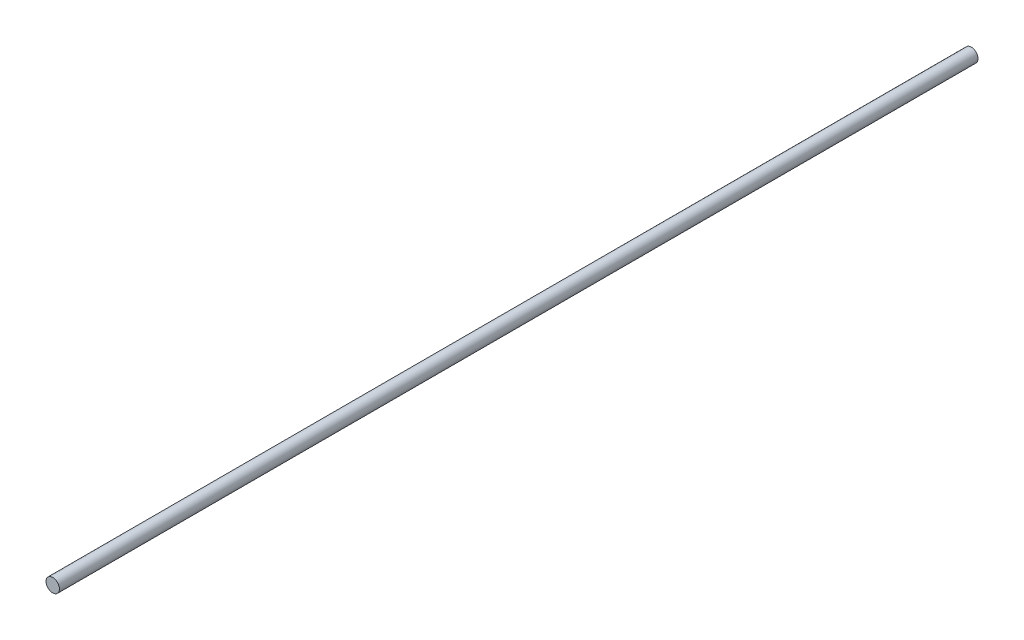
from build123d import *

# Parameters (mm, degrees)
SKETCH1_R           = 30
BOSS_EXTRUDE1_DEPTH = 4100


with BuildPart() as part:
    # Sketch1 → Boss-Extrude1 (new body)
    with BuildSketch(Plane.XY):
        Circle(SKETCH1_R)
    extrude(amount=-BOSS_EXTRUDE1_DEPTH)


solid = part.part
